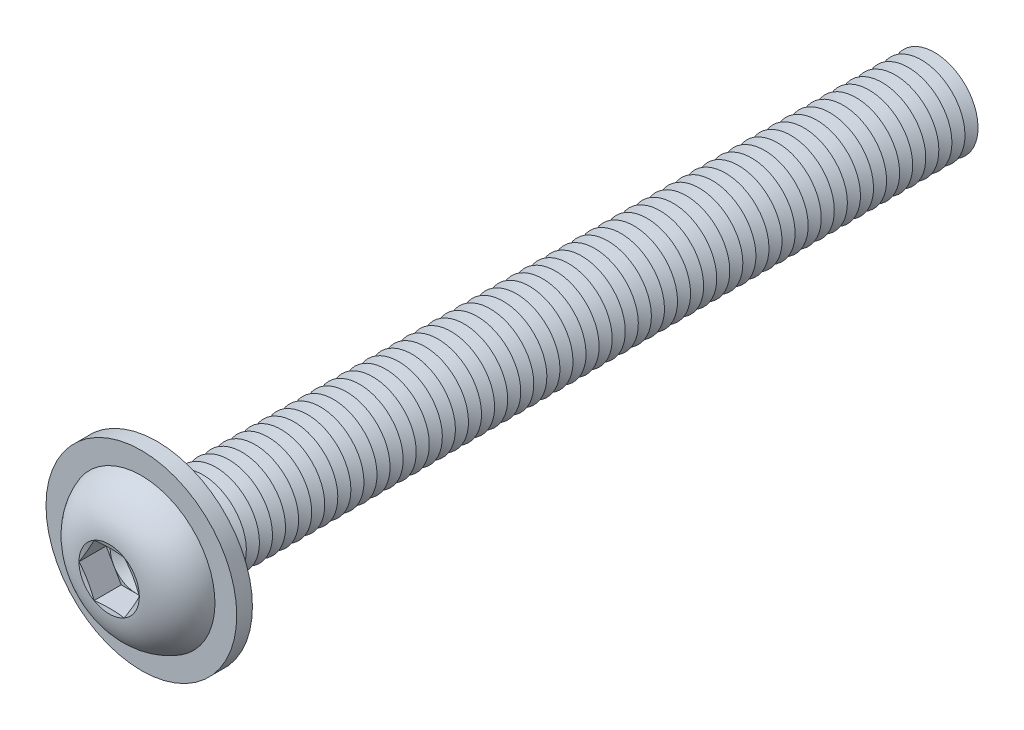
from build123d import *

# Parameters (mm, degrees)
FILLET1_R           = 0.75
LPATTERN1_COUNT     = 60
LPATTERN1_PITCH     = 1.5
CUT_EXTRUDE1_DEPTH  = 3.12
SKETCH5_R           = 10.95
SKETCH5_R_2         = 5.75
BOSS_EXTRUDE1_DEPTH = 1.8


with BuildPart() as part:
    # Sketch1 → Revolve1 (revolve)
    with BuildSketch(Plane(origin=(0, 0, 0), x_dir=(0, 0, -1), z_dir=(1, 0, 0))):
        with BuildLine():
            Line((0, 5), (0, 8.75))
            ThreePointArc((0, 8.75), (-3.814142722, 7.21429474), (-5.5, 3.4641))
            Line((-5.5, 3.4641), (-5.035898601, 1.73205))
            Line((-5.035898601, 1.73205), (-5.5, 1.73205))
            Line((-5.5, 1.73205), (-5.5, 0))
            Line((-5.5, 0), (90, 0))
            Line((90, 0), (90, 5))
            Line((90, 5), (0, 5))
        make_face()
    revolve(axis=Axis((0, 0, -90), (0, 0, 1)))

    # Fillet1
    fillet1_edges = [part.edges().sort_by_distance(p)[0] for p in [
        (0, -5, 0),
    ]]
    fillet(fillet1_edges, radius=FILLET1_R)

    # Sketch2 → Cut-Revolve1 (revolve, cut)
    with BuildSketch(Plane(origin=(0, 0, 0), x_dir=(0, 0, -1), z_dir=(1, 0, 0))):
        Polygon((89.25, 5), (90.75, 5), (90, 3.700961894), align=None)
    cut_revolve1 = revolve(axis=Axis((0, 0, -90), (0, 0, -1)), mode=Mode.SUBTRACT)

    # LPattern1: Cut-Revolve1 ×60
    with Locations(*[(0, 0, i * LPATTERN1_PITCH) for i in range(1, LPATTERN1_COUNT)]):
        add(cut_revolve1, mode=Mode.SUBTRACT)

    # Sketch3 → Cut-Extrude1 (cut)
    with BuildSketch(Plane.XY.offset(5.5)):
        Polygon((1.73205, 2.999998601), (-1.73205, 2.999998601), (-3.4641, 0), (-1.73205, -2.999998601), (1.73205, -2.999998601), (3.4641, 0), align=None)
    extrude(amount=-CUT_EXTRUDE1_DEPTH, mode=Mode.SUBTRACT)

    # Cut-Extrude2 cone 1 section (on through the dimple's axis) → Cut-Extrude2 (revolve, cut)
    with BuildSketch(Plane(origin=(0, 0, 2.38), x_dir=(0, -1, 0), z_dir=(1, 0, 0))):
        Polygon((0, 0), (2.999998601, 0), (0, 1.73205), align=None)
    revolve(axis=Axis((0, 0, 2.38), (0, 0, -1)), mode=Mode.SUBTRACT)

    # Sketch5 → Boss-Extrude1 (add)
    with BuildSketch(Plane(origin=(0, 0, 0), x_dir=(-1, 0, 0), z_dir=(0, 0, -1))):
        with Locations(Location((0, 0, 0), (0, 0, 90))):
            Circle(SKETCH5_R)
        Circle(SKETCH5_R_2, mode=Mode.SUBTRACT)
    extrude(amount=-BOSS_EXTRUDE1_DEPTH)


solid = part.part
